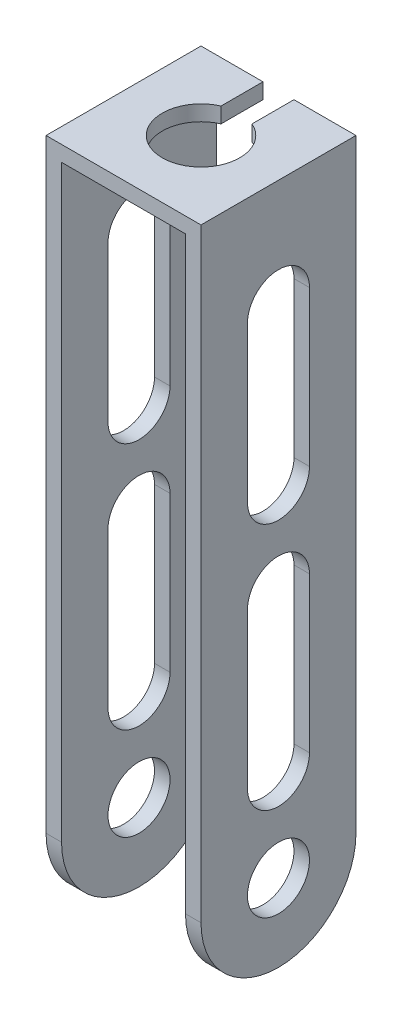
ISO-10303-21;
HEADER;
FILE_DESCRIPTION(('STEP AP214'),'2;1');
FILE_NAME('part.step','',(''),(''),'','','');
FILE_SCHEMA(('AUTOMOTIVE_DESIGN { 1 0 10303 214 1 1 1 1 }'));
ENDSEC;
DATA;
#1=APPLICATION_CONTEXT('core data for automotive mechanical design processes');
#2=APPLICATION_PROTOCOL_DEFINITION('international standard','automotive_design',2000,#1);
#3=PRODUCT_CONTEXT('',#1,'mechanical');
#4=PRODUCT('Part','Part','',(#3));
#5=PRODUCT_RELATED_PRODUCT_CATEGORY('part','',(#4));
#6=PRODUCT_DEFINITION_FORMATION('','',#4);
#7=PRODUCT_DEFINITION_CONTEXT('part definition',#1,'design');
#8=PRODUCT_DEFINITION('design','',#6,#7);
#9=PRODUCT_DEFINITION_SHAPE('','',#8);
#10=(LENGTH_UNIT() NAMED_UNIT(*) SI_UNIT(.MILLI.,.METRE.));
#11=(NAMED_UNIT(*) PLANE_ANGLE_UNIT() SI_UNIT($,.RADIAN.));
#12=(NAMED_UNIT(*) SI_UNIT($,.STERADIAN.) SOLID_ANGLE_UNIT());
#13=UNCERTAINTY_MEASURE_WITH_UNIT(LENGTH_MEASURE(1.E-05),#10,'distance_accuracy_value','');
#14=(GEOMETRIC_REPRESENTATION_CONTEXT(3) GLOBAL_UNCERTAINTY_ASSIGNED_CONTEXT((#13)) GLOBAL_UNIT_ASSIGNED_CONTEXT((#10,
#11,#12)) REPRESENTATION_CONTEXT('',''));
#15=CARTESIAN_POINT('',(0.,0.,0.));
#16=DIRECTION('',(0.,0.,1.));
#17=DIRECTION('',(1.,0.,0.));
#18=AXIS2_PLACEMENT_3D('',#15,#16,#17);
#19=CARTESIAN_POINT('',(-4.00000000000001,44.,-10.));
#20=DIRECTION('',(0.,0.,-1.));
#21=DIRECTION('',(-1.,0.,0.));
#22=AXIS2_PLACEMENT_3D('',#19,#20,#21);
#23=PLANE('',#22);
#24=DIRECTION('',(0.,-1.,0.));
#25=VECTOR('',#24,1.);
#26=CARTESIAN_POINT('',(0.999999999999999,44.,-10.));
#27=LINE('',#26,#25);
#28=CARTESIAN_POINT('',(0.999999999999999,44.,-10.));
#29=VERTEX_POINT('',#28);
#30=CARTESIAN_POINT('',(0.999999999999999,43.,-10.));
#31=VERTEX_POINT('',#30);
#32=EDGE_CURVE('E43',#29,#31,#27,.T.);
#33=ORIENTED_EDGE('',*,*,#32,.F.);
#34=DIRECTION('',(-1.,0.,0.));
#35=VECTOR('',#34,1.);
#36=CARTESIAN_POINT('',(-5.00000000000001,44.,-10.));
#37=LINE('',#36,#35);
#38=CARTESIAN_POINT('',(5.,44.,-10.));
#39=VERTEX_POINT('',#38);
#40=EDGE_CURVE('E402',#39,#29,#37,.T.);
#41=ORIENTED_EDGE('',*,*,#40,.F.);
#42=DIRECTION('',(0.,1.,0.));
#43=VECTOR('',#42,1.);
#44=CARTESIAN_POINT('',(5.,44.,-10.));
#45=LINE('',#44,#43);
#46=CARTESIAN_POINT('',(4.99999999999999,5.,-10.));
#47=VERTEX_POINT('',#46);
#48=EDGE_CURVE('E416',#47,#39,#45,.T.);
#49=ORIENTED_EDGE('',*,*,#48,.F.);
#50=DIRECTION('',(1.,0.,0.));
#51=VECTOR('',#50,1.);
#52=CARTESIAN_POINT('',(-4.00000000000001,5.,-10.));
#53=LINE('',#52,#51);
#54=CARTESIAN_POINT('',(4.,5.,-10.));
#55=VERTEX_POINT('',#54);
#56=EDGE_CURVE('E435',#47,#55,#53,.F.);
#57=ORIENTED_EDGE('',*,*,#56,.T.);
#58=DIRECTION('',(0.,-1.,0.));
#59=VECTOR('',#58,1.);
#60=CARTESIAN_POINT('',(3.99999999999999,43.,-10.));
#61=LINE('',#60,#59);
#62=CARTESIAN_POINT('',(3.99999999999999,43.,-10.));
#63=VERTEX_POINT('',#62);
#64=EDGE_CURVE('E413',#63,#55,#61,.T.);
#65=ORIENTED_EDGE('',*,*,#64,.F.);
#66=DIRECTION('',(1.,0.,0.));
#67=VECTOR('',#66,1.);
#68=CARTESIAN_POINT('',(-4.00000000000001,43.,-10.));
#69=LINE('',#68,#67);
#70=EDGE_CURVE('E409',#31,#63,#69,.T.);
#71=ORIENTED_EDGE('',*,*,#70,.F.);
#72=EDGE_LOOP('',(#33,#41,#49,#57,#65,#71));
#73=FACE_BOUND('',#72,.T.);
#74=ADVANCED_FACE('F35',(#73),#23,.T.);
#75=CARTESIAN_POINT('',(-5.00000000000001,44.,-10.));
#76=DIRECTION('',(0.,1.,0.));
#77=DIRECTION('',(0.,0.,1.));
#78=AXIS2_PLACEMENT_3D('',#75,#76,#77);
#79=PLANE('',#78);
#80=DIRECTION('',(0.,0.,-1.));
#81=VECTOR('',#80,1.);
#82=CARTESIAN_POINT('',(0.999999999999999,44.,-12.0121739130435));
#83=LINE('',#82,#81);
#84=CARTESIAN_POINT('',(0.999999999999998,44.,-7.29128784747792));
#85=VERTEX_POINT('',#84);
#86=EDGE_CURVE('E248',#85,#29,#83,.T.);
#87=ORIENTED_EDGE('',*,*,#86,.F.);
#88=CARTESIAN_POINT('',(0.,44.,-5.));
#89=DIRECTION('',(0.,1.,0.));
#90=DIRECTION('',(0.,0.,1.));
#91=AXIS2_PLACEMENT_3D('',#88,#89,#90);
#92=CIRCLE('',#91,2.5);
#93=CARTESIAN_POINT('',(-1.,44.,-7.29128784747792));
#94=VERTEX_POINT('',#93);
#95=EDGE_CURVE('E237',#94,#85,#92,.T.);
#96=ORIENTED_EDGE('',*,*,#95,.F.);
#97=DIRECTION('',(0.,0.,1.));
#98=VECTOR('',#97,1.);
#99=CARTESIAN_POINT('',(-1.,44.,-12.0121739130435));
#100=LINE('',#99,#98);
#101=CARTESIAN_POINT('',(-1.,44.,-10.));
#102=VERTEX_POINT('',#101);
#103=EDGE_CURVE('E243',#102,#94,#100,.T.);
#104=ORIENTED_EDGE('',*,*,#103,.F.);
#105=CARTESIAN_POINT('',(-5.00000000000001,44.,-10.));
#106=VERTEX_POINT('',#105);
#107=EDGE_CURVE('E401',#102,#106,#37,.T.);
#108=ORIENTED_EDGE('',*,*,#107,.T.);
#109=DIRECTION('',(0.,0.,1.));
#110=VECTOR('',#109,1.);
#111=CARTESIAN_POINT('',(-5.00000000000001,44.,-10.));
#112=LINE('',#111,#110);
#113=CARTESIAN_POINT('',(-5.00000000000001,44.,0.));
#114=VERTEX_POINT('',#113);
#115=EDGE_CURVE('E418',#106,#114,#112,.T.);
#116=ORIENTED_EDGE('',*,*,#115,.T.);
#117=DIRECTION('',(-1.,0.,0.));
#118=VECTOR('',#117,1.);
#119=CARTESIAN_POINT('',(-5.00000000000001,44.,0.));
#120=LINE('',#119,#118);
#121=CARTESIAN_POINT('',(5.,44.,0.));
#122=VERTEX_POINT('',#121);
#123=EDGE_CURVE('E385',#122,#114,#120,.T.);
#124=ORIENTED_EDGE('',*,*,#123,.F.);
#125=DIRECTION('',(0.,0.,1.));
#126=VECTOR('',#125,1.);
#127=CARTESIAN_POINT('',(5.,44.,-10.));
#128=LINE('',#127,#126);
#129=EDGE_CURVE('E419',#39,#122,#128,.T.);
#130=ORIENTED_EDGE('',*,*,#129,.F.);
#131=ORIENTED_EDGE('',*,*,#40,.T.);
#132=EDGE_LOOP('',(#87,#96,#104,#108,#116,#124,#130,#131));
#133=FACE_BOUND('',#132,.T.);
#134=ADVANCED_FACE('F37',(#133),#79,.T.);
#135=CARTESIAN_POINT('',(5.,44.,-10.));
#136=DIRECTION('',(1.,0.,0.));
#137=DIRECTION('',(0.,1.,0.));
#138=AXIS2_PLACEMENT_3D('',#135,#136,#137);
#139=PLANE('',#138);
#140=CARTESIAN_POINT('',(5.,27.,-5.));
#141=DIRECTION('',(-1.,0.,0.));
#142=DIRECTION('',(0.,0.,-1.));
#143=AXIS2_PLACEMENT_3D('',#140,#141,#142);
#144=CIRCLE('',#143,2.);
#145=CARTESIAN_POINT('',(5.,27.,-7.));
#146=VERTEX_POINT('',#145);
#147=CARTESIAN_POINT('',(5.,27.,-3.));
#148=VERTEX_POINT('',#147);
#149=EDGE_CURVE('E269',#146,#148,#144,.T.);
#150=ORIENTED_EDGE('',*,*,#149,.T.);
#151=DIRECTION('',(0.,1.,0.));
#152=VECTOR('',#151,1.);
#153=CARTESIAN_POINT('',(5.,27.,-3.));
#154=LINE('',#153,#152);
#155=CARTESIAN_POINT('',(5.,37.,-3.));
#156=VERTEX_POINT('',#155);
#157=EDGE_CURVE('E272',#148,#156,#154,.T.);
#158=ORIENTED_EDGE('',*,*,#157,.T.);
#159=CARTESIAN_POINT('',(5.,37.,-5.));
#160=DIRECTION('',(-1.,0.,0.));
#161=DIRECTION('',(0.,0.,-1.));
#162=AXIS2_PLACEMENT_3D('',#159,#160,#161);
#163=CIRCLE('',#162,2.);
#164=CARTESIAN_POINT('',(5.,37.,-7.));
#165=VERTEX_POINT('',#164);
#166=EDGE_CURVE('E58',#156,#165,#163,.T.);
#167=ORIENTED_EDGE('',*,*,#166,.T.);
#168=DIRECTION('',(0.,-1.,0.));
#169=VECTOR('',#168,1.);
#170=CARTESIAN_POINT('',(5.,27.,-7.));
#171=LINE('',#170,#169);
#172=EDGE_CURVE('E276',#165,#146,#171,.T.);
#173=ORIENTED_EDGE('',*,*,#172,.T.);
#174=EDGE_LOOP('',(#150,#158,#167,#173));
#175=FACE_BOUND('',#174,.T.);
#176=CARTESIAN_POINT('',(5.,21.,-5.));
#177=DIRECTION('',(-1.,0.,0.));
#178=DIRECTION('',(0.,0.,1.));
#179=AXIS2_PLACEMENT_3D('',#176,#177,#178);
#180=CIRCLE('',#179,2.);
#181=CARTESIAN_POINT('',(5.,21.,-3.));
#182=VERTEX_POINT('',#181);
#183=CARTESIAN_POINT('',(5.,21.,-7.));
#184=VERTEX_POINT('',#183);
#185=EDGE_CURVE('E322',#182,#184,#180,.T.);
#186=ORIENTED_EDGE('',*,*,#185,.T.);
#187=DIRECTION('',(0.,-1.,0.));
#188=VECTOR('',#187,1.);
#189=CARTESIAN_POINT('',(5.,21.,-7.));
#190=LINE('',#189,#188);
#191=CARTESIAN_POINT('',(4.99999999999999,11.,-7.));
#192=VERTEX_POINT('',#191);
#193=EDGE_CURVE('E325',#184,#192,#190,.T.);
#194=ORIENTED_EDGE('',*,*,#193,.T.);
#195=CARTESIAN_POINT('',(5.,11.,-5.));
#196=DIRECTION('',(-1.,0.,0.));
#197=DIRECTION('',(0.,0.,1.));
#198=AXIS2_PLACEMENT_3D('',#195,#196,#197);
#199=CIRCLE('',#198,2.);
#200=CARTESIAN_POINT('',(5.,11.,-3.));
#201=VERTEX_POINT('',#200);
#202=EDGE_CURVE('E328',#192,#201,#199,.T.);
#203=ORIENTED_EDGE('',*,*,#202,.T.);
#204=DIRECTION('',(0.,1.,0.));
#205=VECTOR('',#204,1.);
#206=CARTESIAN_POINT('',(5.,21.,-3.));
#207=LINE('',#206,#205);
#208=EDGE_CURVE('E331',#201,#182,#207,.T.);
#209=ORIENTED_EDGE('',*,*,#208,.T.);
#210=EDGE_LOOP('',(#186,#194,#203,#209));
#211=FACE_BOUND('',#210,.T.);
#212=CARTESIAN_POINT('',(5.,5.,-5.));
#213=DIRECTION('',(-1.,0.,0.));
#214=DIRECTION('',(0.,0.,1.));
#215=AXIS2_PLACEMENT_3D('',#212,#213,#214);
#216=CIRCLE('',#215,2.);
#217=CARTESIAN_POINT('',(5.,5.,-3.));
#218=VERTEX_POINT('',#217);
#219=EDGE_CURVE('E370',#218,#218,#216,.T.);
#220=ORIENTED_EDGE('',*,*,#219,.T.);
#221=EDGE_LOOP('',(#220));
#222=FACE_BOUND('',#221,.T.);
#223=CARTESIAN_POINT('',(5.,5.,-5.));
#224=DIRECTION('',(1.,0.,0.));
#225=DIRECTION('',(0.,1.,0.));
#226=AXIS2_PLACEMENT_3D('',#223,#224,#225);
#227=CIRCLE('',#226,5.);
#228=CARTESIAN_POINT('',(4.99999999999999,5.,0.));
#229=VERTEX_POINT('',#228);
#230=CARTESIAN_POINT('',(4.99999999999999,0.,-5.));
#231=VERTEX_POINT('',#230);
#232=EDGE_CURVE('E422',#229,#231,#227,.T.);
#233=ORIENTED_EDGE('',*,*,#232,.T.);
#234=CARTESIAN_POINT('',(4.99999999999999,5.,-5.));
#235=DIRECTION('',(1.,0.,0.));
#236=DIRECTION('',(0.,1.,0.));
#237=AXIS2_PLACEMENT_3D('',#234,#235,#236);
#238=CIRCLE('',#237,5.);
#239=EDGE_CURVE('E430',#231,#47,#238,.T.);
#240=ORIENTED_EDGE('',*,*,#239,.T.);
#241=ORIENTED_EDGE('',*,*,#48,.T.);
#242=ORIENTED_EDGE('',*,*,#129,.T.);
#243=DIRECTION('',(0.,1.,0.));
#244=VECTOR('',#243,1.);
#245=CARTESIAN_POINT('',(5.,44.,0.));
#246=LINE('',#245,#244);
#247=EDGE_CURVE('E399',#229,#122,#246,.T.);
#248=ORIENTED_EDGE('',*,*,#247,.F.);
#249=EDGE_LOOP('',(#233,#240,#241,#242,#248));
#250=FACE_BOUND('',#249,.T.);
#251=ADVANCED_FACE('F515',(#175,#211,#222,#250),#139,.T.);
#252=CARTESIAN_POINT('',(3.99999999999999,43.,-10.));
#253=DIRECTION('',(-1.,0.,0.));
#254=DIRECTION('',(0.,-1.,0.));
#255=AXIS2_PLACEMENT_3D('',#252,#253,#254);
#256=PLANE('',#255);
#257=CARTESIAN_POINT('',(4.,27.,-5.));
#258=DIRECTION('',(-1.,0.,0.));
#259=DIRECTION('',(0.,-1.,0.));
#260=AXIS2_PLACEMENT_3D('',#257,#258,#259);
#261=CIRCLE('',#260,2.);
#262=CARTESIAN_POINT('',(4.,27.,-7.));
#263=VERTEX_POINT('',#262);
#264=CARTESIAN_POINT('',(4.,27.,-3.));
#265=VERTEX_POINT('',#264);
#266=EDGE_CURVE('E308',#263,#265,#261,.T.);
#267=ORIENTED_EDGE('',*,*,#266,.F.);
#268=DIRECTION('',(0.,-1.,0.));
#269=VECTOR('',#268,1.);
#270=CARTESIAN_POINT('',(3.99999999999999,43.,-7.));
#271=LINE('',#270,#269);
#272=CARTESIAN_POINT('',(4.,37.,-7.));
#273=VERTEX_POINT('',#272);
#274=EDGE_CURVE('E304',#273,#263,#271,.T.);
#275=ORIENTED_EDGE('',*,*,#274,.F.);
#276=CARTESIAN_POINT('',(4.,37.,-5.));
#277=DIRECTION('',(-1.,0.,0.));
#278=DIRECTION('',(0.,-1.,0.));
#279=AXIS2_PLACEMENT_3D('',#276,#277,#278);
#280=CIRCLE('',#279,2.);
#281=CARTESIAN_POINT('',(4.,37.,-3.));
#282=VERTEX_POINT('',#281);
#283=EDGE_CURVE('E300',#282,#273,#280,.T.);
#284=ORIENTED_EDGE('',*,*,#283,.F.);
#285=DIRECTION('',(0.,1.,0.));
#286=VECTOR('',#285,1.);
#287=CARTESIAN_POINT('',(3.99999999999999,43.,-3.));
#288=LINE('',#287,#286);
#289=EDGE_CURVE('E295',#265,#282,#288,.T.);
#290=ORIENTED_EDGE('',*,*,#289,.F.);
#291=EDGE_LOOP('',(#267,#275,#284,#290));
#292=FACE_BOUND('',#291,.T.);
#293=CARTESIAN_POINT('',(4.,21.,-5.));
#294=DIRECTION('',(-1.,0.,0.));
#295=DIRECTION('',(0.,-1.,0.));
#296=AXIS2_PLACEMENT_3D('',#293,#294,#295);
#297=CIRCLE('',#296,2.);
#298=CARTESIAN_POINT('',(4.,21.,-3.));
#299=VERTEX_POINT('',#298);
#300=CARTESIAN_POINT('',(4.,21.,-7.));
#301=VERTEX_POINT('',#300);
#302=EDGE_CURVE('E364',#299,#301,#297,.T.);
#303=ORIENTED_EDGE('',*,*,#302,.F.);
#304=DIRECTION('',(0.,1.,0.));
#305=VECTOR('',#304,1.);
#306=CARTESIAN_POINT('',(3.99999999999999,43.,-3.));
#307=LINE('',#306,#305);
#308=CARTESIAN_POINT('',(4.,11.,-3.));
#309=VERTEX_POINT('',#308);
#310=EDGE_CURVE('E360',#309,#299,#307,.T.);
#311=ORIENTED_EDGE('',*,*,#310,.F.);
#312=CARTESIAN_POINT('',(4.,11.,-5.));
#313=DIRECTION('',(-1.,0.,0.));
#314=DIRECTION('',(0.,-1.,0.));
#315=AXIS2_PLACEMENT_3D('',#312,#313,#314);
#316=CIRCLE('',#315,2.);
#317=CARTESIAN_POINT('',(4.,11.,-7.));
#318=VERTEX_POINT('',#317);
#319=EDGE_CURVE('E356',#318,#309,#316,.T.);
#320=ORIENTED_EDGE('',*,*,#319,.F.);
#321=DIRECTION('',(0.,-1.,0.));
#322=VECTOR('',#321,1.);
#323=CARTESIAN_POINT('',(3.99999999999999,43.,-7.));
#324=LINE('',#323,#322);
#325=EDGE_CURVE('E351',#301,#318,#324,.T.);
#326=ORIENTED_EDGE('',*,*,#325,.F.);
#327=EDGE_LOOP('',(#303,#311,#320,#326));
#328=FACE_BOUND('',#327,.T.);
#329=CARTESIAN_POINT('',(4.,5.,-5.));
#330=DIRECTION('',(-1.,0.,0.));
#331=DIRECTION('',(0.,-1.,0.));
#332=AXIS2_PLACEMENT_3D('',#329,#330,#331);
#333=CIRCLE('',#332,2.);
#334=CARTESIAN_POINT('',(4.,3.,-5.));
#335=VERTEX_POINT('',#334);
#336=EDGE_CURVE('E376',#335,#335,#333,.T.);
#337=ORIENTED_EDGE('',*,*,#336,.F.);
#338=EDGE_LOOP('',(#337));
#339=FACE_BOUND('',#338,.T.);
#340=ORIENTED_EDGE('',*,*,#64,.T.);
#341=CARTESIAN_POINT('',(4.,5.,-5.));
#342=DIRECTION('',(-1.,0.,0.));
#343=DIRECTION('',(0.,-1.,0.));
#344=AXIS2_PLACEMENT_3D('',#341,#342,#343);
#345=CIRCLE('',#344,5.);
#346=CARTESIAN_POINT('',(4.,0.,-5.));
#347=VERTEX_POINT('',#346);
#348=EDGE_CURVE('E440',#55,#347,#345,.T.);
#349=ORIENTED_EDGE('',*,*,#348,.T.);
#350=CARTESIAN_POINT('',(4.,5.,-5.));
#351=DIRECTION('',(-1.,0.,0.));
#352=DIRECTION('',(0.,-1.,0.));
#353=AXIS2_PLACEMENT_3D('',#350,#351,#352);
#354=CIRCLE('',#353,5.);
#355=CARTESIAN_POINT('',(4.,5.,0.));
#356=VERTEX_POINT('',#355);
#357=EDGE_CURVE('E438',#347,#356,#354,.T.);
#358=ORIENTED_EDGE('',*,*,#357,.T.);
#359=DIRECTION('',(0.,-1.,0.));
#360=VECTOR('',#359,1.);
#361=CARTESIAN_POINT('',(3.99999999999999,43.,0.));
#362=LINE('',#361,#360);
#363=CARTESIAN_POINT('',(3.99999999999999,43.,0.));
#364=VERTEX_POINT('',#363);
#365=EDGE_CURVE('E396',#364,#356,#362,.T.);
#366=ORIENTED_EDGE('',*,*,#365,.F.);
#367=DIRECTION('',(0.,0.,1.));
#368=VECTOR('',#367,1.);
#369=CARTESIAN_POINT('',(3.99999999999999,43.,-10.));
#370=LINE('',#369,#368);
#371=EDGE_CURVE('E423',#63,#364,#370,.T.);
#372=ORIENTED_EDGE('',*,*,#371,.F.);
#373=EDGE_LOOP('',(#340,#349,#358,#366,#372));
#374=FACE_BOUND('',#373,.T.);
#375=ADVANCED_FACE('F468',(#292,#328,#339,#374),#256,.T.);
#376=CARTESIAN_POINT('',(-4.00000000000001,43.,-10.));
#377=DIRECTION('',(0.,-1.,0.));
#378=DIRECTION('',(0.,0.,-1.));
#379=AXIS2_PLACEMENT_3D('',#376,#377,#378);
#380=PLANE('',#379);
#381=DIRECTION('',(0.,0.,1.));
#382=VECTOR('',#381,1.);
#383=CARTESIAN_POINT('',(0.999999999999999,43.,-10.));
#384=LINE('',#383,#382);
#385=CARTESIAN_POINT('',(0.999999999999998,43.,-7.29128784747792));
#386=VERTEX_POINT('',#385);
#387=EDGE_CURVE('E256',#31,#386,#384,.T.);
#388=ORIENTED_EDGE('',*,*,#387,.F.);
#389=ORIENTED_EDGE('',*,*,#70,.T.);
#390=ORIENTED_EDGE('',*,*,#371,.T.);
#391=DIRECTION('',(1.,0.,0.));
#392=VECTOR('',#391,1.);
#393=CARTESIAN_POINT('',(-4.00000000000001,43.,0.));
#394=LINE('',#393,#392);
#395=CARTESIAN_POINT('',(-4.00000000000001,43.,0.));
#396=VERTEX_POINT('',#395);
#397=EDGE_CURVE('E393',#396,#364,#394,.T.);
#398=ORIENTED_EDGE('',*,*,#397,.F.);
#399=DIRECTION('',(0.,0.,1.));
#400=VECTOR('',#399,1.);
#401=CARTESIAN_POINT('',(-4.00000000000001,43.,-10.));
#402=LINE('',#401,#400);
#403=CARTESIAN_POINT('',(-4.00000000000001,43.,-10.));
#404=VERTEX_POINT('',#403);
#405=EDGE_CURVE('E425',#404,#396,#402,.T.);
#406=ORIENTED_EDGE('',*,*,#405,.F.);
#407=CARTESIAN_POINT('',(-1.,43.,-10.));
#408=VERTEX_POINT('',#407);
#409=EDGE_CURVE('E410',#404,#408,#69,.T.);
#410=ORIENTED_EDGE('',*,*,#409,.T.);
#411=DIRECTION('',(0.,0.,-1.));
#412=VECTOR('',#411,1.);
#413=CARTESIAN_POINT('',(-1.,43.,-10.));
#414=LINE('',#413,#412);
#415=CARTESIAN_POINT('',(-1.,43.,-7.29128784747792));
#416=VERTEX_POINT('',#415);
#417=EDGE_CURVE('E50',#416,#408,#414,.T.);
#418=ORIENTED_EDGE('',*,*,#417,.F.);
#419=CARTESIAN_POINT('',(0.,43.,-5.));
#420=DIRECTION('',(0.,-1.,0.));
#421=DIRECTION('',(0.,0.,-1.));
#422=AXIS2_PLACEMENT_3D('',#419,#420,#421);
#423=CIRCLE('',#422,2.5);
#424=EDGE_CURVE('E11',#386,#416,#423,.T.);
#425=ORIENTED_EDGE('',*,*,#424,.F.);
#426=EDGE_LOOP('',(#388,#389,#390,#398,#406,#410,#418,#425));
#427=FACE_BOUND('',#426,.T.);
#428=ADVANCED_FACE('F462',(#427),#380,.T.);
#429=CARTESIAN_POINT('',(-4.00000000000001,43.,-10.));
#430=DIRECTION('',(1.,0.,0.));
#431=DIRECTION('',(0.,0.,-1.));
#432=AXIS2_PLACEMENT_3D('',#429,#430,#431);
#433=PLANE('',#432);
#434=CARTESIAN_POINT('',(-4.,27.,-5.));
#435=DIRECTION('',(1.,0.,0.));
#436=DIRECTION('',(0.,0.,-1.));
#437=AXIS2_PLACEMENT_3D('',#434,#435,#436);
#438=CIRCLE('',#437,2.);
#439=CARTESIAN_POINT('',(-4.,27.,-3.));
#440=VERTEX_POINT('',#439);
#441=CARTESIAN_POINT('',(-4.,27.,-7.));
#442=VERTEX_POINT('',#441);
#443=EDGE_CURVE('E306',#440,#442,#438,.T.);
#444=ORIENTED_EDGE('',*,*,#443,.F.);
#445=DIRECTION('',(0.,-1.,0.));
#446=VECTOR('',#445,1.);
#447=CARTESIAN_POINT('',(-4.00000000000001,43.,-3.));
#448=LINE('',#447,#446);
#449=CARTESIAN_POINT('',(-4.00000000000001,37.,-3.));
#450=VERTEX_POINT('',#449);
#451=EDGE_CURVE('E283',#450,#440,#448,.T.);
#452=ORIENTED_EDGE('',*,*,#451,.F.);
#453=CARTESIAN_POINT('',(-4.,37.,-5.));
#454=DIRECTION('',(1.,0.,0.));
#455=DIRECTION('',(0.,0.,-1.));
#456=AXIS2_PLACEMENT_3D('',#453,#454,#455);
#457=CIRCLE('',#456,2.);
#458=CARTESIAN_POINT('',(-4.,37.,-7.));
#459=VERTEX_POINT('',#458);
#460=EDGE_CURVE('E297',#459,#450,#457,.T.);
#461=ORIENTED_EDGE('',*,*,#460,.F.);
#462=DIRECTION('',(0.,1.,0.));
#463=VECTOR('',#462,1.);
#464=CARTESIAN_POINT('',(-4.00000000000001,43.,-7.));
#465=LINE('',#464,#463);
#466=EDGE_CURVE('E302',#442,#459,#465,.T.);
#467=ORIENTED_EDGE('',*,*,#466,.F.);
#468=EDGE_LOOP('',(#444,#452,#461,#467));
#469=FACE_BOUND('',#468,.T.);
#470=CARTESIAN_POINT('',(-4.,21.,-5.));
#471=DIRECTION('',(1.,0.,0.));
#472=DIRECTION('',(0.,0.,-1.));
#473=AXIS2_PLACEMENT_3D('',#470,#471,#472);
#474=CIRCLE('',#473,2.);
#475=CARTESIAN_POINT('',(-4.,21.,-7.));
#476=VERTEX_POINT('',#475);
#477=CARTESIAN_POINT('',(-4.,21.,-3.));
#478=VERTEX_POINT('',#477);
#479=EDGE_CURVE('E362',#476,#478,#474,.T.);
#480=ORIENTED_EDGE('',*,*,#479,.F.);
#481=DIRECTION('',(0.,1.,0.));
#482=VECTOR('',#481,1.);
#483=CARTESIAN_POINT('',(-4.00000000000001,43.,-7.));
#484=LINE('',#483,#482);
#485=CARTESIAN_POINT('',(-4.00000000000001,11.,-7.));
#486=VERTEX_POINT('',#485);
#487=EDGE_CURVE('E338',#486,#476,#484,.T.);
#488=ORIENTED_EDGE('',*,*,#487,.F.);
#489=CARTESIAN_POINT('',(-4.,11.,-5.));
#490=DIRECTION('',(1.,0.,0.));
#491=DIRECTION('',(0.,0.,-1.));
#492=AXIS2_PLACEMENT_3D('',#489,#490,#491);
#493=CIRCLE('',#492,2.);
#494=CARTESIAN_POINT('',(-4.,11.,-3.));
#495=VERTEX_POINT('',#494);
#496=EDGE_CURVE('E353',#495,#486,#493,.T.);
#497=ORIENTED_EDGE('',*,*,#496,.F.);
#498=DIRECTION('',(0.,-1.,0.));
#499=VECTOR('',#498,1.);
#500=CARTESIAN_POINT('',(-4.00000000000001,43.,-3.));
#501=LINE('',#500,#499);
#502=EDGE_CURVE('E358',#478,#495,#501,.T.);
#503=ORIENTED_EDGE('',*,*,#502,.F.);
#504=EDGE_LOOP('',(#480,#488,#497,#503));
#505=FACE_BOUND('',#504,.T.);
#506=CARTESIAN_POINT('',(-4.,5.,-5.));
#507=DIRECTION('',(1.,0.,0.));
#508=DIRECTION('',(0.,0.,-1.));
#509=AXIS2_PLACEMENT_3D('',#506,#507,#508);
#510=CIRCLE('',#509,2.);
#511=CARTESIAN_POINT('',(-4.,5.,-7.));
#512=VERTEX_POINT('',#511);
#513=EDGE_CURVE('E373',#512,#512,#510,.T.);
#514=ORIENTED_EDGE('',*,*,#513,.F.);
#515=EDGE_LOOP('',(#514));
#516=FACE_BOUND('',#515,.T.);
#517=CARTESIAN_POINT('',(-4.00000000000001,5.,-5.));
#518=DIRECTION('',(1.,0.,0.));
#519=DIRECTION('',(0.,0.,-1.));
#520=AXIS2_PLACEMENT_3D('',#517,#518,#519);
#521=CIRCLE('',#520,5.);
#522=CARTESIAN_POINT('',(-4.00000000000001,5.,0.));
#523=VERTEX_POINT('',#522);
#524=CARTESIAN_POINT('',(-4.00000000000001,0.,-5.));
#525=VERTEX_POINT('',#524);
#526=EDGE_CURVE('E442',#523,#525,#521,.T.);
#527=ORIENTED_EDGE('',*,*,#526,.T.);
#528=CARTESIAN_POINT('',(-4.00000000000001,5.,-5.));
#529=DIRECTION('',(1.,0.,0.));
#530=DIRECTION('',(0.,0.,-1.));
#531=AXIS2_PLACEMENT_3D('',#528,#529,#530);
#532=CIRCLE('',#531,5.);
#533=CARTESIAN_POINT('',(-4.00000000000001,5.,-10.));
#534=VERTEX_POINT('',#533);
#535=EDGE_CURVE('E444',#525,#534,#532,.T.);
#536=ORIENTED_EDGE('',*,*,#535,.T.);
#537=DIRECTION('',(0.,1.,0.));
#538=VECTOR('',#537,1.);
#539=CARTESIAN_POINT('',(-4.00000000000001,43.,-10.));
#540=LINE('',#539,#538);
#541=EDGE_CURVE('E407',#534,#404,#540,.T.);
#542=ORIENTED_EDGE('',*,*,#541,.T.);
#543=ORIENTED_EDGE('',*,*,#405,.T.);
#544=DIRECTION('',(0.,1.,0.));
#545=VECTOR('',#544,1.);
#546=CARTESIAN_POINT('',(-4.00000000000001,43.,0.));
#547=LINE('',#546,#545);
#548=EDGE_CURVE('E391',#523,#396,#547,.T.);
#549=ORIENTED_EDGE('',*,*,#548,.F.);
#550=EDGE_LOOP('',(#527,#536,#542,#543,#549));
#551=FACE_BOUND('',#550,.T.);
#552=ADVANCED_FACE('F481',(#469,#505,#516,#551),#433,.T.);
#553=CARTESIAN_POINT('',(-5.00000000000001,44.,-10.));
#554=DIRECTION('',(-1.,0.,0.));
#555=DIRECTION('',(0.,0.,1.));
#556=AXIS2_PLACEMENT_3D('',#553,#554,#555);
#557=PLANE('',#556);
#558=CARTESIAN_POINT('',(-5.00000000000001,27.,-5.));
#559=DIRECTION('',(-1.,0.,0.));
#560=DIRECTION('',(0.,0.,-1.));
#561=AXIS2_PLACEMENT_3D('',#558,#559,#560);
#562=CIRCLE('',#561,2.);
#563=CARTESIAN_POINT('',(-5.00000000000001,27.,-7.));
#564=VERTEX_POINT('',#563);
#565=CARTESIAN_POINT('',(-5.00000000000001,27.,-3.));
#566=VERTEX_POINT('',#565);
#567=EDGE_CURVE('E258',#564,#566,#562,.T.);
#568=ORIENTED_EDGE('',*,*,#567,.F.);
#569=DIRECTION('',(0.,-1.,0.));
#570=VECTOR('',#569,1.);
#571=CARTESIAN_POINT('',(-5.00000000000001,27.,-7.));
#572=LINE('',#571,#570);
#573=CARTESIAN_POINT('',(-5.00000000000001,37.,-7.));
#574=VERTEX_POINT('',#573);
#575=EDGE_CURVE('E266',#574,#564,#572,.T.);
#576=ORIENTED_EDGE('',*,*,#575,.F.);
#577=CARTESIAN_POINT('',(-5.00000000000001,37.,-5.));
#578=DIRECTION('',(-1.,0.,0.));
#579=DIRECTION('',(0.,0.,-1.));
#580=AXIS2_PLACEMENT_3D('',#577,#578,#579);
#581=CIRCLE('',#580,2.);
#582=CARTESIAN_POINT('',(-5.00000000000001,37.,-3.));
#583=VERTEX_POINT('',#582);
#584=EDGE_CURVE('E263',#583,#574,#581,.T.);
#585=ORIENTED_EDGE('',*,*,#584,.F.);
#586=DIRECTION('',(0.,1.,0.));
#587=VECTOR('',#586,1.);
#588=CARTESIAN_POINT('',(-5.00000000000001,27.,-3.));
#589=LINE('',#588,#587);
#590=EDGE_CURVE('E260',#566,#583,#589,.T.);
#591=ORIENTED_EDGE('',*,*,#590,.F.);
#592=EDGE_LOOP('',(#568,#576,#585,#591));
#593=FACE_BOUND('',#592,.T.);
#594=CARTESIAN_POINT('',(-5.00000000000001,21.,-5.));
#595=DIRECTION('',(-1.,0.,0.));
#596=DIRECTION('',(0.,0.,1.));
#597=AXIS2_PLACEMENT_3D('',#594,#595,#596);
#598=CIRCLE('',#597,2.);
#599=CARTESIAN_POINT('',(-5.00000000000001,21.,-3.));
#600=VERTEX_POINT('',#599);
#601=CARTESIAN_POINT('',(-5.00000000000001,21.,-7.));
#602=VERTEX_POINT('',#601);
#603=EDGE_CURVE('E311',#600,#602,#598,.T.);
#604=ORIENTED_EDGE('',*,*,#603,.F.);
#605=DIRECTION('',(0.,1.,0.));
#606=VECTOR('',#605,1.);
#607=CARTESIAN_POINT('',(-5.00000000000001,21.,-3.));
#608=LINE('',#607,#606);
#609=CARTESIAN_POINT('',(-5.00000000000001,11.,-3.));
#610=VERTEX_POINT('',#609);
#611=EDGE_CURVE('E319',#610,#600,#608,.T.);
#612=ORIENTED_EDGE('',*,*,#611,.F.);
#613=CARTESIAN_POINT('',(-5.00000000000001,11.,-5.));
#614=DIRECTION('',(-1.,0.,0.));
#615=DIRECTION('',(0.,0.,1.));
#616=AXIS2_PLACEMENT_3D('',#613,#614,#615);
#617=CIRCLE('',#616,2.);
#618=CARTESIAN_POINT('',(-5.00000000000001,11.,-7.));
#619=VERTEX_POINT('',#618);
#620=EDGE_CURVE('E316',#619,#610,#617,.T.);
#621=ORIENTED_EDGE('',*,*,#620,.F.);
#622=DIRECTION('',(0.,-1.,0.));
#623=VECTOR('',#622,1.);
#624=CARTESIAN_POINT('',(-5.00000000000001,21.,-7.));
#625=LINE('',#624,#623);
#626=EDGE_CURVE('E313',#602,#619,#625,.T.);
#627=ORIENTED_EDGE('',*,*,#626,.F.);
#628=EDGE_LOOP('',(#604,#612,#621,#627));
#629=FACE_BOUND('',#628,.T.);
#630=CARTESIAN_POINT('',(-5.00000000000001,5.,-5.));
#631=DIRECTION('',(-1.,0.,0.));
#632=DIRECTION('',(0.,0.,1.));
#633=AXIS2_PLACEMENT_3D('',#630,#631,#632);
#634=CIRCLE('',#633,2.);
#635=CARTESIAN_POINT('',(-5.00000000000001,5.,-3.));
#636=VERTEX_POINT('',#635);
#637=EDGE_CURVE('E367',#636,#636,#634,.T.);
#638=ORIENTED_EDGE('',*,*,#637,.F.);
#639=EDGE_LOOP('',(#638));
#640=FACE_BOUND('',#639,.T.);
#641=DIRECTION('',(0.,-1.,0.));
#642=VECTOR('',#641,1.);
#643=CARTESIAN_POINT('',(-5.00000000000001,44.,-10.));
#644=LINE('',#643,#642);
#645=CARTESIAN_POINT('',(-5.00000000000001,5.,-10.));
#646=VERTEX_POINT('',#645);
#647=EDGE_CURVE('E404',#106,#646,#644,.T.);
#648=ORIENTED_EDGE('',*,*,#647,.T.);
#649=CARTESIAN_POINT('',(-5.00000000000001,5.,-5.));
#650=DIRECTION('',(-1.,0.,0.));
#651=DIRECTION('',(0.,0.,1.));
#652=AXIS2_PLACEMENT_3D('',#649,#650,#651);
#653=CIRCLE('',#652,5.);
#654=CARTESIAN_POINT('',(-5.00000000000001,0.,-5.));
#655=VERTEX_POINT('',#654);
#656=EDGE_CURVE('E448',#646,#655,#653,.T.);
#657=ORIENTED_EDGE('',*,*,#656,.T.);
#658=CARTESIAN_POINT('',(-5.00000000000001,5.,-5.));
#659=DIRECTION('',(-1.,0.,0.));
#660=DIRECTION('',(0.,0.,1.));
#661=AXIS2_PLACEMENT_3D('',#658,#659,#660);
#662=CIRCLE('',#661,5.);
#663=CARTESIAN_POINT('',(-5.00000000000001,5.,0.));
#664=VERTEX_POINT('',#663);
#665=EDGE_CURVE('E446',#655,#664,#662,.T.);
#666=ORIENTED_EDGE('',*,*,#665,.T.);
#667=DIRECTION('',(0.,-1.,0.));
#668=VECTOR('',#667,1.);
#669=CARTESIAN_POINT('',(-5.00000000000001,44.,0.));
#670=LINE('',#669,#668);
#671=EDGE_CURVE('E388',#114,#664,#670,.T.);
#672=ORIENTED_EDGE('',*,*,#671,.F.);
#673=ORIENTED_EDGE('',*,*,#115,.F.);
#674=EDGE_LOOP('',(#648,#657,#666,#672,#673));
#675=FACE_BOUND('',#674,.T.);
#676=ADVANCED_FACE('F493',(#593,#629,#640,#675),#557,.T.);
#677=DIRECTION('',(0.,1.,0.));
#678=VECTOR('',#677,1.);
#679=CARTESIAN_POINT('',(-1.,44.,-10.));
#680=LINE('',#679,#678);
#681=EDGE_CURVE('E245',#408,#102,#680,.T.);
#682=ORIENTED_EDGE('',*,*,#681,.F.);
#683=ORIENTED_EDGE('',*,*,#409,.F.);
#684=ORIENTED_EDGE('',*,*,#541,.F.);
#685=DIRECTION('',(1.,0.,0.));
#686=VECTOR('',#685,1.);
#687=CARTESIAN_POINT('',(-4.00000000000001,5.,-10.));
#688=LINE('',#687,#686);
#689=EDGE_CURVE('E432',#534,#646,#688,.F.);
#690=ORIENTED_EDGE('',*,*,#689,.T.);
#691=ORIENTED_EDGE('',*,*,#647,.F.);
#692=ORIENTED_EDGE('',*,*,#107,.F.);
#693=EDGE_LOOP('',(#682,#683,#684,#690,#691,#692));
#694=FACE_BOUND('',#693,.T.);
#695=ADVANCED_FACE('F486',(#694),#23,.T.);
#696=CARTESIAN_POINT('',(-4.00000000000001,44.,0.));
#697=DIRECTION('',(0.,0.,-1.));
#698=DIRECTION('',(-1.,0.,0.));
#699=AXIS2_PLACEMENT_3D('',#696,#697,#698);
#700=PLANE('',#699);
#701=ORIENTED_EDGE('',*,*,#671,.T.);
#702=DIRECTION('',(1.,0.,0.));
#703=VECTOR('',#702,1.);
#704=CARTESIAN_POINT('',(-4.00000000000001,5.,0.));
#705=LINE('',#704,#703);
#706=EDGE_CURVE('E452',#664,#523,#705,.T.);
#707=ORIENTED_EDGE('',*,*,#706,.T.);
#708=ORIENTED_EDGE('',*,*,#548,.T.);
#709=ORIENTED_EDGE('',*,*,#397,.T.);
#710=ORIENTED_EDGE('',*,*,#365,.T.);
#711=DIRECTION('',(1.,0.,0.));
#712=VECTOR('',#711,1.);
#713=CARTESIAN_POINT('',(5.,5.,0.));
#714=LINE('',#713,#712);
#715=EDGE_CURVE('E450',#356,#229,#714,.T.);
#716=ORIENTED_EDGE('',*,*,#715,.T.);
#717=ORIENTED_EDGE('',*,*,#247,.T.);
#718=ORIENTED_EDGE('',*,*,#123,.T.);
#719=EDGE_LOOP('',(#701,#707,#708,#709,#710,#716,#717,#718));
#720=FACE_BOUND('',#719,.T.);
#721=ADVANCED_FACE('F475',(#720),#700,.F.);
#722=CARTESIAN_POINT('',(-4.00000000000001,5.,-5.));
#723=DIRECTION('',(-1.,0.,0.));
#724=DIRECTION('',(0.,-1.,0.));
#725=AXIS2_PLACEMENT_3D('',#722,#723,#724);
#726=CYLINDRICAL_SURFACE('',#725,5.);
#727=ORIENTED_EDGE('',*,*,#715,.F.);
#728=ORIENTED_EDGE('',*,*,#357,.F.);
#729=DIRECTION('',(1.,0.,0.));
#730=VECTOR('',#729,1.);
#731=CARTESIAN_POINT('',(4.,0.,-5.));
#732=LINE('',#731,#730);
#733=EDGE_CURVE('E382',#231,#347,#732,.F.);
#734=ORIENTED_EDGE('',*,*,#733,.F.);
#735=ORIENTED_EDGE('',*,*,#232,.F.);
#736=EDGE_LOOP('',(#727,#728,#734,#735));
#737=FACE_BOUND('',#736,.T.);
#738=ADVANCED_FACE('F507',(#737),#726,.T.);
#739=CARTESIAN_POINT('',(4.,5.,-5.));
#740=DIRECTION('',(1.,0.,0.));
#741=DIRECTION('',(0.,1.,0.));
#742=AXIS2_PLACEMENT_3D('',#739,#740,#741);
#743=CYLINDRICAL_SURFACE('',#742,5.);
#744=ORIENTED_EDGE('',*,*,#348,.F.);
#745=ORIENTED_EDGE('',*,*,#56,.F.);
#746=ORIENTED_EDGE('',*,*,#239,.F.);
#747=ORIENTED_EDGE('',*,*,#733,.T.);
#748=EDGE_LOOP('',(#744,#745,#746,#747));
#749=FACE_BOUND('',#748,.T.);
#750=ADVANCED_FACE('F499',(#749),#743,.T.);
#751=CARTESIAN_POINT('',(-4.00000000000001,5.,-5.));
#752=DIRECTION('',(-1.,0.,0.));
#753=DIRECTION('',(0.,0.,1.));
#754=AXIS2_PLACEMENT_3D('',#751,#752,#753);
#755=CYLINDRICAL_SURFACE('',#754,5.);
#756=ORIENTED_EDGE('',*,*,#706,.F.);
#757=ORIENTED_EDGE('',*,*,#665,.F.);
#758=DIRECTION('',(1.,0.,0.));
#759=VECTOR('',#758,1.);
#760=CARTESIAN_POINT('',(-5.00000000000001,0.,-5.));
#761=LINE('',#760,#759);
#762=EDGE_CURVE('E379',#525,#655,#761,.F.);
#763=ORIENTED_EDGE('',*,*,#762,.F.);
#764=ORIENTED_EDGE('',*,*,#526,.F.);
#765=EDGE_LOOP('',(#756,#757,#763,#764));
#766=FACE_BOUND('',#765,.T.);
#767=ADVANCED_FACE('F497',(#766),#755,.T.);
#768=CARTESIAN_POINT('',(-5.00000000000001,5.,-5.));
#769=DIRECTION('',(1.,0.,0.));
#770=DIRECTION('',(0.,0.,-1.));
#771=AXIS2_PLACEMENT_3D('',#768,#769,#770);
#772=CYLINDRICAL_SURFACE('',#771,5.);
#773=ORIENTED_EDGE('',*,*,#656,.F.);
#774=ORIENTED_EDGE('',*,*,#689,.F.);
#775=ORIENTED_EDGE('',*,*,#535,.F.);
#776=ORIENTED_EDGE('',*,*,#762,.T.);
#777=EDGE_LOOP('',(#773,#774,#775,#776));
#778=FACE_BOUND('',#777,.T.);
#779=ADVANCED_FACE('F489',(#778),#772,.T.);
#780=CARTESIAN_POINT('',(5.,5.,-5.));
#781=DIRECTION('',(-1.,0.,0.));
#782=DIRECTION('',(0.,0.,1.));
#783=AXIS2_PLACEMENT_3D('',#780,#781,#782);
#784=CYLINDRICAL_SURFACE('',#783,2.);
#785=ORIENTED_EDGE('',*,*,#513,.T.);
#786=EDGE_LOOP('',(#785));
#787=FACE_BOUND('',#786,.T.);
#788=ORIENTED_EDGE('',*,*,#637,.T.);
#789=EDGE_LOOP('',(#788));
#790=FACE_BOUND('',#789,.T.);
#791=ADVANCED_FACE('F505',(#787,#790),#784,.F.);
#792=ORIENTED_EDGE('',*,*,#336,.T.);
#793=EDGE_LOOP('',(#792));
#794=FACE_BOUND('',#793,.T.);
#795=ORIENTED_EDGE('',*,*,#219,.F.);
#796=EDGE_LOOP('',(#795));
#797=FACE_BOUND('',#796,.T.);
#798=ADVANCED_FACE('F605',(#794,#797),#784,.F.);
#799=CARTESIAN_POINT('',(5.,21.,-7.));
#800=DIRECTION('',(0.,0.,-1.));
#801=DIRECTION('',(0.,1.,0.));
#802=AXIS2_PLACEMENT_3D('',#799,#800,#801);
#803=PLANE('',#802);
#804=ORIENTED_EDGE('',*,*,#487,.T.);
#805=DIRECTION('',(-1.,0.,0.));
#806=VECTOR('',#805,1.);
#807=CARTESIAN_POINT('',(5.,21.,-7.));
#808=LINE('',#807,#806);
#809=EDGE_CURVE('E334',#476,#602,#808,.T.);
#810=ORIENTED_EDGE('',*,*,#809,.T.);
#811=ORIENTED_EDGE('',*,*,#626,.T.);
#812=DIRECTION('',(-1.,0.,0.));
#813=VECTOR('',#812,1.);
#814=CARTESIAN_POINT('',(5.,11.,-7.));
#815=LINE('',#814,#813);
#816=EDGE_CURVE('E347',#486,#619,#815,.T.);
#817=ORIENTED_EDGE('',*,*,#816,.F.);
#818=EDGE_LOOP('',(#804,#810,#811,#817));
#819=FACE_BOUND('',#818,.T.);
#820=ADVANCED_FACE('F615',(#819),#803,.F.);
#821=CARTESIAN_POINT('',(5.,11.,-5.));
#822=DIRECTION('',(-1.,0.,0.));
#823=DIRECTION('',(0.,0.,1.));
#824=AXIS2_PLACEMENT_3D('',#821,#822,#823);
#825=CYLINDRICAL_SURFACE('',#824,2.);
#826=ORIENTED_EDGE('',*,*,#496,.T.);
#827=ORIENTED_EDGE('',*,*,#816,.T.);
#828=ORIENTED_EDGE('',*,*,#620,.T.);
#829=DIRECTION('',(-1.,0.,0.));
#830=VECTOR('',#829,1.);
#831=CARTESIAN_POINT('',(5.,11.,-3.));
#832=LINE('',#831,#830);
#833=EDGE_CURVE('E343',#495,#610,#832,.T.);
#834=ORIENTED_EDGE('',*,*,#833,.F.);
#835=EDGE_LOOP('',(#826,#827,#828,#834));
#836=FACE_BOUND('',#835,.T.);
#837=ADVANCED_FACE('F624',(#836),#825,.F.);
#838=CARTESIAN_POINT('',(5.,21.,-3.));
#839=DIRECTION('',(0.,0.,1.));
#840=DIRECTION('',(0.,-1.,0.));
#841=AXIS2_PLACEMENT_3D('',#838,#839,#840);
#842=PLANE('',#841);
#843=ORIENTED_EDGE('',*,*,#502,.T.);
#844=ORIENTED_EDGE('',*,*,#833,.T.);
#845=ORIENTED_EDGE('',*,*,#611,.T.);
#846=DIRECTION('',(-1.,0.,0.));
#847=VECTOR('',#846,1.);
#848=CARTESIAN_POINT('',(5.,21.,-3.));
#849=LINE('',#848,#847);
#850=EDGE_CURVE('E339',#478,#600,#849,.T.);
#851=ORIENTED_EDGE('',*,*,#850,.F.);
#852=EDGE_LOOP('',(#843,#844,#845,#851));
#853=FACE_BOUND('',#852,.T.);
#854=ADVANCED_FACE('F635',(#853),#842,.F.);
#855=CARTESIAN_POINT('',(5.,21.,-5.));
#856=DIRECTION('',(-1.,0.,0.));
#857=DIRECTION('',(0.,0.,1.));
#858=AXIS2_PLACEMENT_3D('',#855,#856,#857);
#859=CYLINDRICAL_SURFACE('',#858,2.);
#860=ORIENTED_EDGE('',*,*,#479,.T.);
#861=ORIENTED_EDGE('',*,*,#850,.T.);
#862=ORIENTED_EDGE('',*,*,#603,.T.);
#863=ORIENTED_EDGE('',*,*,#809,.F.);
#864=EDGE_LOOP('',(#860,#861,#862,#863));
#865=FACE_BOUND('',#864,.T.);
#866=ADVANCED_FACE('F646',(#865),#859,.F.);
#867=ORIENTED_EDGE('',*,*,#302,.T.);
#868=EDGE_CURVE('E348',#184,#301,#808,.T.);
#869=ORIENTED_EDGE('',*,*,#868,.F.);
#870=ORIENTED_EDGE('',*,*,#185,.F.);
#871=EDGE_CURVE('E335',#182,#299,#849,.T.);
#872=ORIENTED_EDGE('',*,*,#871,.T.);
#873=EDGE_LOOP('',(#867,#869,#870,#872));
#874=FACE_BOUND('',#873,.T.);
#875=ADVANCED_FACE('F657',(#874),#859,.F.);
#876=ORIENTED_EDGE('',*,*,#310,.T.);
#877=ORIENTED_EDGE('',*,*,#871,.F.);
#878=ORIENTED_EDGE('',*,*,#208,.F.);
#879=EDGE_CURVE('E340',#201,#309,#832,.T.);
#880=ORIENTED_EDGE('',*,*,#879,.T.);
#881=EDGE_LOOP('',(#876,#877,#878,#880));
#882=FACE_BOUND('',#881,.T.);
#883=ADVANCED_FACE('F649',(#882),#842,.F.);
#884=ORIENTED_EDGE('',*,*,#319,.T.);
#885=ORIENTED_EDGE('',*,*,#879,.F.);
#886=ORIENTED_EDGE('',*,*,#202,.F.);
#887=EDGE_CURVE('E344',#192,#318,#815,.T.);
#888=ORIENTED_EDGE('',*,*,#887,.T.);
#889=EDGE_LOOP('',(#884,#885,#886,#888));
#890=FACE_BOUND('',#889,.T.);
#891=ADVANCED_FACE('F638',(#890),#825,.F.);
#892=ORIENTED_EDGE('',*,*,#325,.T.);
#893=ORIENTED_EDGE('',*,*,#887,.F.);
#894=ORIENTED_EDGE('',*,*,#193,.F.);
#895=ORIENTED_EDGE('',*,*,#868,.T.);
#896=EDGE_LOOP('',(#892,#893,#894,#895));
#897=FACE_BOUND('',#896,.T.);
#898=ADVANCED_FACE('F627',(#897),#803,.F.);
#899=CARTESIAN_POINT('',(5.,27.,-3.));
#900=DIRECTION('',(0.,0.,1.));
#901=DIRECTION('',(0.,-1.,0.));
#902=AXIS2_PLACEMENT_3D('',#899,#900,#901);
#903=PLANE('',#902);
#904=ORIENTED_EDGE('',*,*,#451,.T.);
#905=DIRECTION('',(-1.,0.,0.));
#906=VECTOR('',#905,1.);
#907=CARTESIAN_POINT('',(5.,27.,-3.));
#908=LINE('',#907,#906);
#909=EDGE_CURVE('E279',#440,#566,#908,.T.);
#910=ORIENTED_EDGE('',*,*,#909,.T.);
#911=ORIENTED_EDGE('',*,*,#590,.T.);
#912=DIRECTION('',(-1.,0.,0.));
#913=VECTOR('',#912,1.);
#914=CARTESIAN_POINT('',(5.,37.,-3.));
#915=LINE('',#914,#913);
#916=EDGE_CURVE('E291',#450,#583,#915,.T.);
#917=ORIENTED_EDGE('',*,*,#916,.F.);
#918=EDGE_LOOP('',(#904,#910,#911,#917));
#919=FACE_BOUND('',#918,.T.);
#920=ADVANCED_FACE('F691',(#919),#903,.F.);
#921=CARTESIAN_POINT('',(5.,37.,-5.));
#922=DIRECTION('',(-1.,0.,0.));
#923=DIRECTION('',(0.,0.,1.));
#924=AXIS2_PLACEMENT_3D('',#921,#922,#923);
#925=CYLINDRICAL_SURFACE('',#924,2.);
#926=ORIENTED_EDGE('',*,*,#460,.T.);
#927=ORIENTED_EDGE('',*,*,#916,.T.);
#928=ORIENTED_EDGE('',*,*,#584,.T.);
#929=DIRECTION('',(-1.,0.,0.));
#930=VECTOR('',#929,1.);
#931=CARTESIAN_POINT('',(5.,37.,-7.));
#932=LINE('',#931,#930);
#933=EDGE_CURVE('E288',#459,#574,#932,.T.);
#934=ORIENTED_EDGE('',*,*,#933,.F.);
#935=EDGE_LOOP('',(#926,#927,#928,#934));
#936=FACE_BOUND('',#935,.T.);
#937=ADVANCED_FACE('F700',(#936),#925,.F.);
#938=CARTESIAN_POINT('',(5.,27.,-7.));
#939=DIRECTION('',(0.,0.,-1.));
#940=DIRECTION('',(0.,1.,0.));
#941=AXIS2_PLACEMENT_3D('',#938,#939,#940);
#942=PLANE('',#941);
#943=ORIENTED_EDGE('',*,*,#466,.T.);
#944=ORIENTED_EDGE('',*,*,#933,.T.);
#945=ORIENTED_EDGE('',*,*,#575,.T.);
#946=DIRECTION('',(-1.,0.,0.));
#947=VECTOR('',#946,1.);
#948=CARTESIAN_POINT('',(5.,27.,-7.));
#949=LINE('',#948,#947);
#950=EDGE_CURVE('E284',#442,#564,#949,.T.);
#951=ORIENTED_EDGE('',*,*,#950,.F.);
#952=EDGE_LOOP('',(#943,#944,#945,#951));
#953=FACE_BOUND('',#952,.T.);
#954=ADVANCED_FACE('F711',(#953),#942,.F.);
#955=CARTESIAN_POINT('',(5.,27.,-5.));
#956=DIRECTION('',(-1.,0.,0.));
#957=DIRECTION('',(0.,0.,1.));
#958=AXIS2_PLACEMENT_3D('',#955,#956,#957);
#959=CYLINDRICAL_SURFACE('',#958,2.);
#960=ORIENTED_EDGE('',*,*,#443,.T.);
#961=ORIENTED_EDGE('',*,*,#950,.T.);
#962=ORIENTED_EDGE('',*,*,#567,.T.);
#963=ORIENTED_EDGE('',*,*,#909,.F.);
#964=EDGE_LOOP('',(#960,#961,#962,#963));
#965=FACE_BOUND('',#964,.T.);
#966=ADVANCED_FACE('F722',(#965),#959,.F.);
#967=ORIENTED_EDGE('',*,*,#266,.T.);
#968=EDGE_CURVE('E292',#148,#265,#908,.T.);
#969=ORIENTED_EDGE('',*,*,#968,.F.);
#970=ORIENTED_EDGE('',*,*,#149,.F.);
#971=EDGE_CURVE('E280',#146,#263,#949,.T.);
#972=ORIENTED_EDGE('',*,*,#971,.T.);
#973=EDGE_LOOP('',(#967,#969,#970,#972));
#974=FACE_BOUND('',#973,.T.);
#975=ADVANCED_FACE('F733',(#974),#959,.F.);
#976=ORIENTED_EDGE('',*,*,#274,.T.);
#977=ORIENTED_EDGE('',*,*,#971,.F.);
#978=ORIENTED_EDGE('',*,*,#172,.F.);
#979=EDGE_CURVE('E285',#165,#273,#932,.T.);
#980=ORIENTED_EDGE('',*,*,#979,.T.);
#981=EDGE_LOOP('',(#976,#977,#978,#980));
#982=FACE_BOUND('',#981,.T.);
#983=ADVANCED_FACE('F725',(#982),#942,.F.);
#984=ORIENTED_EDGE('',*,*,#283,.T.);
#985=ORIENTED_EDGE('',*,*,#979,.F.);
#986=ORIENTED_EDGE('',*,*,#166,.F.);
#987=EDGE_CURVE('E289',#156,#282,#915,.T.);
#988=ORIENTED_EDGE('',*,*,#987,.T.);
#989=EDGE_LOOP('',(#984,#985,#986,#988));
#990=FACE_BOUND('',#989,.T.);
#991=ADVANCED_FACE('F714',(#990),#925,.F.);
#992=ORIENTED_EDGE('',*,*,#289,.T.);
#993=ORIENTED_EDGE('',*,*,#987,.F.);
#994=ORIENTED_EDGE('',*,*,#157,.F.);
#995=ORIENTED_EDGE('',*,*,#968,.T.);
#996=EDGE_LOOP('',(#992,#993,#994,#995));
#997=FACE_BOUND('',#996,.T.);
#998=ADVANCED_FACE('F703',(#997),#903,.F.);
#999=CARTESIAN_POINT('',(0.999999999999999,34.,-12.0121739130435));
#1000=DIRECTION('',(1.,0.,0.));
#1001=DIRECTION('',(0.,0.,-1.));
#1002=AXIS2_PLACEMENT_3D('',#999,#1000,#1001);
#1003=PLANE('',#1002);
#1004=ORIENTED_EDGE('',*,*,#387,.T.);
#1005=DIRECTION('',(0.,1.,0.));
#1006=VECTOR('',#1005,1.);
#1007=CARTESIAN_POINT('',(0.999999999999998,34.,-7.29128784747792));
#1008=LINE('',#1007,#1006);
#1009=EDGE_CURVE('E240',#386,#85,#1008,.T.);
#1010=ORIENTED_EDGE('',*,*,#1009,.T.);
#1011=ORIENTED_EDGE('',*,*,#86,.T.);
#1012=ORIENTED_EDGE('',*,*,#32,.T.);
#1013=EDGE_LOOP('',(#1004,#1010,#1011,#1012));
#1014=FACE_BOUND('',#1013,.T.);
#1015=ADVANCED_FACE('F457',(#1014),#1003,.F.);
#1016=CARTESIAN_POINT('',(0.,34.,-5.));
#1017=DIRECTION('',(0.,1.,0.));
#1018=DIRECTION('',(0.,0.,1.));
#1019=AXIS2_PLACEMENT_3D('',#1016,#1017,#1018);
#1020=CYLINDRICAL_SURFACE('',#1019,2.5);
#1021=ORIENTED_EDGE('',*,*,#424,.T.);
#1022=DIRECTION('',(0.,1.,0.));
#1023=VECTOR('',#1022,1.);
#1024=CARTESIAN_POINT('',(-1.,34.,-7.29128784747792));
#1025=LINE('',#1024,#1023);
#1026=EDGE_CURVE('E232',#416,#94,#1025,.T.);
#1027=ORIENTED_EDGE('',*,*,#1026,.T.);
#1028=ORIENTED_EDGE('',*,*,#95,.T.);
#1029=ORIENTED_EDGE('',*,*,#1009,.F.);
#1030=EDGE_LOOP('',(#1021,#1027,#1028,#1029));
#1031=FACE_BOUND('',#1030,.T.);
#1032=ADVANCED_FACE('F234',(#1031),#1020,.F.);
#1033=CARTESIAN_POINT('',(-1.,34.,-12.0121739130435));
#1034=DIRECTION('',(-1.,0.,0.));
#1035=DIRECTION('',(0.,0.,1.));
#1036=AXIS2_PLACEMENT_3D('',#1033,#1034,#1035);
#1037=PLANE('',#1036);
#1038=ORIENTED_EDGE('',*,*,#417,.T.);
#1039=ORIENTED_EDGE('',*,*,#681,.T.);
#1040=ORIENTED_EDGE('',*,*,#103,.T.);
#1041=ORIENTED_EDGE('',*,*,#1026,.F.);
#1042=EDGE_LOOP('',(#1038,#1039,#1040,#1041));
#1043=FACE_BOUND('',#1042,.T.);
#1044=ADVANCED_FACE('F244',(#1043),#1037,.F.);
#1045=CLOSED_SHELL('',(#74,#134,#251,#375,#428,#552,#676,#695,#721,#738,#750,#767,#779,#791,
#798,#820,#837,#854,#866,#875,#883,#891,#898,#920,#937,#954,#966,#975,#983,#991,#998,#1015,
#1032,#1044));
#1046=MANIFOLD_SOLID_BREP('B2',#1045);
#1047=ADVANCED_BREP_SHAPE_REPRESENTATION('',(#18,#1046),#14);
#1048=SHAPE_DEFINITION_REPRESENTATION(#9,#1047);
ENDSEC;
END-ISO-10303-21;
